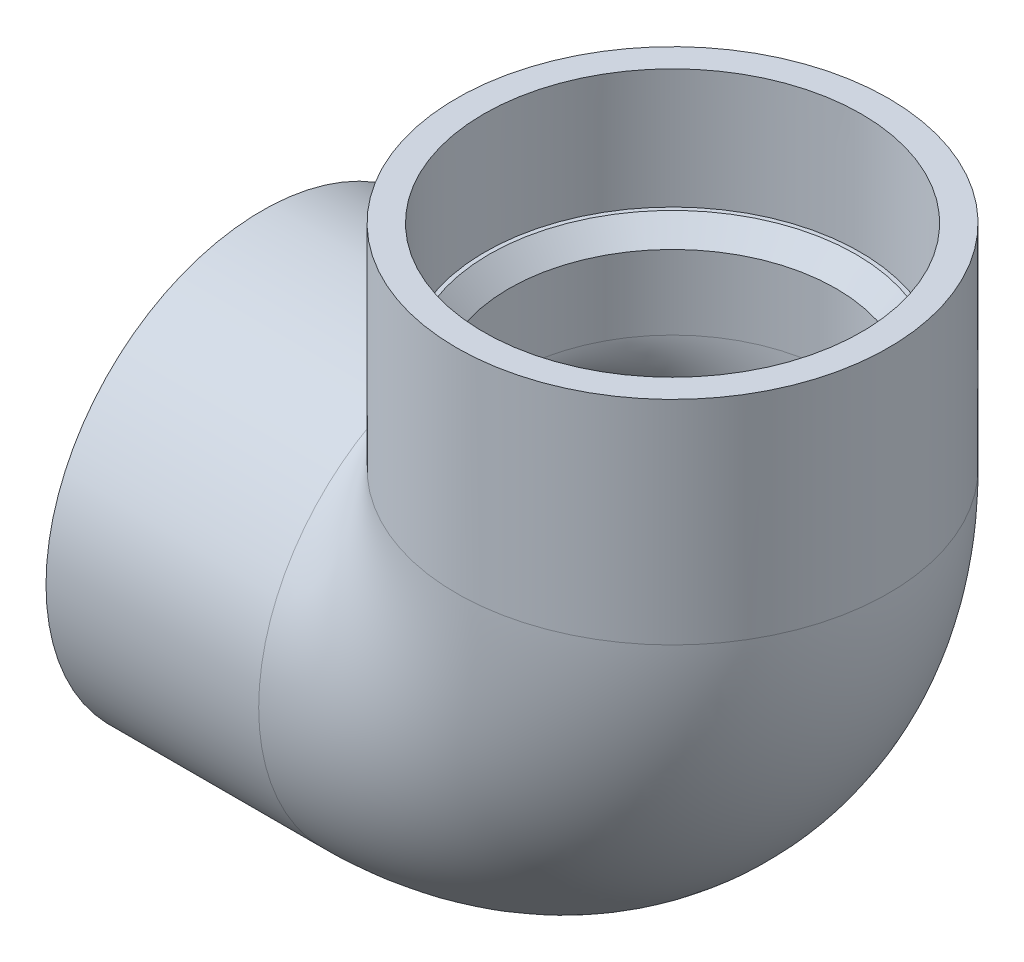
ISO-10303-21;
HEADER;
FILE_DESCRIPTION(('STEP AP214'),'2;1');
FILE_NAME('part.step','',(''),(''),'','','');
FILE_SCHEMA(('AUTOMOTIVE_DESIGN { 1 0 10303 214 1 1 1 1 }'));
ENDSEC;
DATA;
#1=APPLICATION_CONTEXT('core data for automotive mechanical design processes');
#2=APPLICATION_PROTOCOL_DEFINITION('international standard','automotive_design',2000,#1);
#3=PRODUCT_CONTEXT('',#1,'mechanical');
#4=PRODUCT('Part','Part','',(#3));
#5=PRODUCT_RELATED_PRODUCT_CATEGORY('part','',(#4));
#6=PRODUCT_DEFINITION_FORMATION('','',#4);
#7=PRODUCT_DEFINITION_CONTEXT('part definition',#1,'design');
#8=PRODUCT_DEFINITION('design','',#6,#7);
#9=PRODUCT_DEFINITION_SHAPE('','',#8);
#10=(LENGTH_UNIT() NAMED_UNIT(*) SI_UNIT(.MILLI.,.METRE.));
#11=(NAMED_UNIT(*) PLANE_ANGLE_UNIT() SI_UNIT($,.RADIAN.));
#12=(NAMED_UNIT(*) SI_UNIT($,.STERADIAN.) SOLID_ANGLE_UNIT());
#13=UNCERTAINTY_MEASURE_WITH_UNIT(LENGTH_MEASURE(1.E-05),#10,'distance_accuracy_value','');
#14=(GEOMETRIC_REPRESENTATION_CONTEXT(3) GLOBAL_UNCERTAINTY_ASSIGNED_CONTEXT((#13)) GLOBAL_UNIT_ASSIGNED_CONTEXT((#10,
#11,#12)) REPRESENTATION_CONTEXT('',''));
#15=CARTESIAN_POINT('',(0.,0.,0.));
#16=DIRECTION('',(0.,0.,1.));
#17=DIRECTION('',(1.,0.,0.));
#18=AXIS2_PLACEMENT_3D('',#15,#16,#17);
#19=CARTESIAN_POINT('',(-65.88125,-34.671,0.));
#20=DIRECTION('',(-1.,0.,0.));
#21=DIRECTION('',(0.,0.,1.));
#22=AXIS2_PLACEMENT_3D('',#19,#20,#21);
#23=PLANE('',#22);
#24=CARTESIAN_POINT('',(-65.88125,0.,0.));
#25=DIRECTION('',(-1.,0.,0.));
#26=DIRECTION('',(0.,0.,1.));
#27=AXIS2_PLACEMENT_3D('',#24,#25,#26);
#28=CIRCLE('',#27,34.671);
#29=CARTESIAN_POINT('',(-65.88125,0.,34.671));
#30=VERTEX_POINT('',#29);
#31=EDGE_CURVE('E58',#30,#30,#28,.T.);
#32=ORIENTED_EDGE('',*,*,#31,.T.);
#33=EDGE_LOOP('',(#32));
#34=FACE_BOUND('',#33,.T.);
#35=CARTESIAN_POINT('',(-65.88125,0.,0.));
#36=DIRECTION('',(-1.,0.,0.));
#37=DIRECTION('',(0.,0.,1.));
#38=AXIS2_PLACEMENT_3D('',#35,#36,#37);
#39=CIRCLE('',#38,30.3149);
#40=CARTESIAN_POINT('',(-65.88125,0.,30.3149));
#41=VERTEX_POINT('',#40);
#42=EDGE_CURVE('E72',#41,#41,#39,.T.);
#43=ORIENTED_EDGE('',*,*,#42,.F.);
#44=EDGE_LOOP('',(#43));
#45=FACE_BOUND('',#44,.T.);
#46=ADVANCED_FACE('F36',(#34,#45),#23,.T.);
#47=CARTESIAN_POINT('',(-31.75,0.,0.));
#48=DIRECTION('',(-1.,0.,0.));
#49=DIRECTION('',(0.,0.,1.));
#50=AXIS2_PLACEMENT_3D('',#47,#48,#49);
#51=CONICAL_SURFACE('',#50,30.0863,0.00669757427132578);
#52=ORIENTED_EDGE('',*,*,#42,.T.);
#53=EDGE_LOOP('',(#52));
#54=FACE_BOUND('',#53,.T.);
#55=CARTESIAN_POINT('',(-31.75,0.,0.));
#56=DIRECTION('',(-1.,0.,0.));
#57=DIRECTION('',(0.,0.,1.));
#58=AXIS2_PLACEMENT_3D('',#55,#56,#57);
#59=CIRCLE('',#58,30.0863);
#60=CARTESIAN_POINT('',(-31.75,0.,30.0863));
#61=VERTEX_POINT('',#60);
#62=EDGE_CURVE('E69',#61,#61,#59,.T.);
#63=ORIENTED_EDGE('',*,*,#62,.F.);
#64=EDGE_LOOP('',(#63));
#65=FACE_BOUND('',#64,.T.);
#66=ADVANCED_FACE('F104',(#54,#65),#51,.F.);
#67=CARTESIAN_POINT('',(-65.88125,0.,0.));
#68=DIRECTION('',(-1.,0.,0.));
#69=DIRECTION('',(0.,0.,1.));
#70=AXIS2_PLACEMENT_3D('',#67,#68,#69);
#71=CYLINDRICAL_SURFACE('',#70,34.671);
#72=CARTESIAN_POINT('',(0.,0.,0.));
#73=DIRECTION('',(-0.707106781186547,-0.707106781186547,0.));
#74=DIRECTION('',(-0.707106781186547,0.707106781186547,0.));
#75=AXIS2_PLACEMENT_3D('',#72,#73,#74);
#76=ELLIPSE('',#75,49.0321984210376,34.671);
#77=CARTESIAN_POINT('',(-31.75,31.75,-13.928953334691));
#78=VERTEX_POINT('',#77);
#79=CARTESIAN_POINT('',(-31.75,31.75,13.928953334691));
#80=VERTEX_POINT('',#79);
#81=EDGE_CURVE('E57',#78,#80,#76,.F.);
#82=ORIENTED_EDGE('',*,*,#81,.F.);
#83=CARTESIAN_POINT('',(-31.75,0.,0.));
#84=DIRECTION('',(-1.,0.,0.));
#85=DIRECTION('',(0.,0.,1.));
#86=AXIS2_PLACEMENT_3D('',#83,#84,#85);
#87=CIRCLE('',#86,34.671);
#88=EDGE_CURVE('E64',#78,#80,#87,.T.);
#89=ORIENTED_EDGE('',*,*,#88,.T.);
#90=EDGE_LOOP('',(#82,#89));
#91=FACE_BOUND('',#90,.T.);
#92=ORIENTED_EDGE('',*,*,#31,.F.);
#93=EDGE_LOOP('',(#92));
#94=FACE_BOUND('',#93,.T.);
#95=ADVANCED_FACE('F62',(#91,#94),#71,.T.);
#96=CARTESIAN_POINT('',(-31.75,31.75,0.));
#97=DIRECTION('',(0.,0.,-1.));
#98=DIRECTION('',(-1.,0.,0.));
#99=AXIS2_PLACEMENT_3D('',#96,#97,#98);
#100=TOROIDAL_SURFACE('',#99,31.75,26.2509);
#101=CARTESIAN_POINT('',(0.,31.75,0.));
#102=DIRECTION('',(0.,1.,0.));
#103=DIRECTION('',(0.,0.,-1.));
#104=AXIS2_PLACEMENT_3D('',#101,#102,#103);
#105=CIRCLE('',#104,26.2509);
#106=CARTESIAN_POINT('',(26.2509,31.75,0.));
#107=VERTEX_POINT('',#106);
#108=EDGE_CURVE('E59',#107,#107,#105,.T.);
#109=CARTESIAN_POINT('',(-31.75,0.,0.));
#110=DIRECTION('',(1.,0.,0.));
#111=DIRECTION('',(0.,0.,-1.));
#112=AXIS2_PLACEMENT_3D('',#109,#110,#111);
#113=CIRCLE('',#112,26.2509);
#114=CARTESIAN_POINT('',(-31.75,-26.2509,0.));
#115=VERTEX_POINT('',#114);
#116=EDGE_CURVE('E65',#115,#115,#113,.T.);
#117=CARTESIAN_POINT('',(-31.75,31.75,0.));
#118=DIRECTION('',(0.,0.,-1.));
#119=DIRECTION('',(-1.,0.,0.));
#120=AXIS2_PLACEMENT_3D('',#117,#118,#119);
#121=CIRCLE('',#120,58.0009);
#122=EDGE_CURVE('',#107,#115,#121,.T.);
#123=ORIENTED_EDGE('',*,*,#108,.T.);
#124=ORIENTED_EDGE('',*,*,#116,.F.);
#125=ORIENTED_EDGE('',*,*,#122,.T.);
#126=ORIENTED_EDGE('',*,*,#122,.F.);
#127=EDGE_LOOP('',(#123,#125,#124,#126));
#128=FACE_BOUND('',#127,.T.);
#129=ADVANCED_FACE('F116',(#128),#100,.F.);
#130=CARTESIAN_POINT('',(-63.5,31.75,0.));
#131=DIRECTION('',(0.,-1.,0.));
#132=DIRECTION('',(-1.,0.,0.));
#133=AXIS2_PLACEMENT_3D('',#130,#131,#132);
#134=CIRCLE('',#133,34.671);
#135=TRIMMED_CURVE('',#134,(PARAMETER_VALUE(-2.72816941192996)),
(PARAMETER_VALUE(2.72816941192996)),.T.,.PARAMETER.);
#136=CARTESIAN_POINT('',(-31.75,31.75,0.));
#137=DIRECTION('',(0.,0.,-1.));
#138=AXIS1_PLACEMENT('',#136,#137);
#139=SURFACE_OF_REVOLUTION('',#135,#138);
#140=CARTESIAN_POINT('',(0.,31.75,0.));
#141=DIRECTION('',(0.,1.,0.));
#142=DIRECTION('',(0.,0.,-1.));
#143=AXIS2_PLACEMENT_3D('',#140,#141,#142);
#144=CIRCLE('',#143,34.671);
#145=EDGE_CURVE('E51',#80,#78,#144,.T.);
#146=ORIENTED_EDGE('',*,*,#145,.F.);
#147=ORIENTED_EDGE('',*,*,#88,.F.);
#148=EDGE_LOOP('',(#146,#147));
#149=FACE_BOUND('',#148,.T.);
#150=ADVANCED_FACE('F68',(#149),#139,.T.);
#151=CARTESIAN_POINT('',(34.671,65.88125,0.));
#152=DIRECTION('',(0.,1.,0.));
#153=DIRECTION('',(0.,0.,1.));
#154=AXIS2_PLACEMENT_3D('',#151,#152,#153);
#155=PLANE('',#154);
#156=CARTESIAN_POINT('',(0.,65.88125,0.));
#157=DIRECTION('',(0.,-1.,0.));
#158=DIRECTION('',(0.,0.,-1.));
#159=AXIS2_PLACEMENT_3D('',#156,#157,#158);
#160=CIRCLE('',#159,30.3149);
#161=CARTESIAN_POINT('',(0.,65.88125,-30.3149));
#162=VERTEX_POINT('',#161);
#163=EDGE_CURVE('E167',#162,#162,#160,.T.);
#164=ORIENTED_EDGE('',*,*,#163,.T.);
#165=EDGE_LOOP('',(#164));
#166=FACE_BOUND('',#165,.T.);
#167=CARTESIAN_POINT('',(0.,65.88125,0.));
#168=DIRECTION('',(0.,-1.,0.));
#169=DIRECTION('',(0.,0.,-1.));
#170=AXIS2_PLACEMENT_3D('',#167,#168,#169);
#171=CIRCLE('',#170,34.671);
#172=CARTESIAN_POINT('',(0.,65.88125,-34.671));
#173=VERTEX_POINT('',#172);
#174=EDGE_CURVE('E66',#173,#173,#171,.T.);
#175=ORIENTED_EDGE('',*,*,#174,.F.);
#176=EDGE_LOOP('',(#175));
#177=FACE_BOUND('',#176,.T.);
#178=ADVANCED_FACE('F119',(#166,#177),#155,.T.);
#179=CARTESIAN_POINT('',(0.,0.,0.));
#180=DIRECTION('',(0.,-1.,0.));
#181=DIRECTION('',(0.,0.,-1.));
#182=AXIS2_PLACEMENT_3D('',#179,#180,#181);
#183=CYLINDRICAL_SURFACE('',#182,34.671);
#184=ORIENTED_EDGE('',*,*,#174,.T.);
#185=EDGE_LOOP('',(#184));
#186=FACE_BOUND('',#185,.T.);
#187=ORIENTED_EDGE('',*,*,#145,.T.);
#188=ORIENTED_EDGE('',*,*,#81,.T.);
#189=EDGE_LOOP('',(#187,#188));
#190=FACE_BOUND('',#189,.T.);
#191=ADVANCED_FACE('F56',(#186,#190),#183,.T.);
#192=CARTESIAN_POINT('',(0.,65.88125,0.));
#193=DIRECTION('',(0.,1.,0.));
#194=DIRECTION('',(0.,0.,1.));
#195=AXIS2_PLACEMENT_3D('',#192,#193,#194);
#196=CONICAL_SURFACE('',#195,30.3149,0.00669757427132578);
#197=CARTESIAN_POINT('',(0.,31.75,0.));
#198=DIRECTION('',(0.,1.,0.));
#199=DIRECTION('',(-1.,0.,0.));
#200=AXIS2_PLACEMENT_3D('',#197,#198,#199);
#201=CIRCLE('',#200,30.0863);
#202=CARTESIAN_POINT('',(-30.0863,31.75,0.));
#203=VERTEX_POINT('',#202);
#204=EDGE_CURVE('E162',#203,#203,#201,.T.);
#205=ORIENTED_EDGE('',*,*,#204,.F.);
#206=EDGE_LOOP('',(#205));
#207=FACE_BOUND('',#206,.T.);
#208=ORIENTED_EDGE('',*,*,#163,.F.);
#209=EDGE_LOOP('',(#208));
#210=FACE_BOUND('',#209,.T.);
#211=ADVANCED_FACE('F128',(#207,#210),#196,.F.);
#212=CARTESIAN_POINT('',(-150.978157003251,0.,0.));
#213=DIRECTION('',(1.,0.,0.));
#214=DIRECTION('',(0.,0.,-1.));
#215=AXIS2_PLACEMENT_3D('',#212,#213,#214);
#216=CYLINDRICAL_SURFACE('',#215,30.0863);
#217=ORIENTED_EDGE('',*,*,#62,.T.);
#218=EDGE_LOOP('',(#217));
#219=FACE_BOUND('',#218,.T.);
#220=CARTESIAN_POINT('',(-46.83125,0.,0.));
#221=DIRECTION('',(-1.,0.,0.));
#222=DIRECTION('',(0.,0.,1.));
#223=AXIS2_PLACEMENT_3D('',#220,#221,#222);
#224=CIRCLE('',#223,30.0863);
#225=CARTESIAN_POINT('',(-46.83125,0.,30.0863));
#226=VERTEX_POINT('',#225);
#227=EDGE_CURVE('E161',#226,#226,#224,.T.);
#228=ORIENTED_EDGE('',*,*,#227,.F.);
#229=EDGE_LOOP('',(#228));
#230=FACE_BOUND('',#229,.T.);
#231=ADVANCED_FACE('F132',(#219,#230),#216,.T.);
#232=CARTESIAN_POINT('',(-150.978157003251,0.,0.));
#233=DIRECTION('',(1.,0.,0.));
#234=DIRECTION('',(0.,0.,-1.));
#235=AXIS2_PLACEMENT_3D('',#232,#233,#234);
#236=CYLINDRICAL_SURFACE('',#235,26.2509);
#237=CARTESIAN_POINT('',(-43.65625,0.,0.));
#238=DIRECTION('',(-1.,0.,0.));
#239=DIRECTION('',(0.,0.,1.));
#240=AXIS2_PLACEMENT_3D('',#237,#238,#239);
#241=CIRCLE('',#240,26.2509);
#242=CARTESIAN_POINT('',(-43.65625,0.,26.2509));
#243=VERTEX_POINT('',#242);
#244=EDGE_CURVE('E81',#243,#243,#241,.T.);
#245=ORIENTED_EDGE('',*,*,#244,.T.);
#246=EDGE_LOOP('',(#245));
#247=FACE_BOUND('',#246,.T.);
#248=ORIENTED_EDGE('',*,*,#116,.T.);
#249=EDGE_LOOP('',(#248));
#250=FACE_BOUND('',#249,.T.);
#251=ADVANCED_FACE('F136',(#247,#250),#236,.F.);
#252=CARTESIAN_POINT('',(-46.83125,-34.671,0.));
#253=DIRECTION('',(-1.,0.,0.));
#254=DIRECTION('',(0.,0.,1.));
#255=AXIS2_PLACEMENT_3D('',#252,#253,#254);
#256=PLANE('',#255);
#257=CARTESIAN_POINT('',(-46.83125,0.,0.));
#258=DIRECTION('',(-1.,0.,0.));
#259=DIRECTION('',(0.,0.,1.));
#260=AXIS2_PLACEMENT_3D('',#257,#258,#259);
#261=CIRCLE('',#260,29.4259);
#262=CARTESIAN_POINT('',(-46.83125,0.,29.4259));
#263=VERTEX_POINT('',#262);
#264=EDGE_CURVE('E85',#263,#263,#261,.F.);
#265=ORIENTED_EDGE('',*,*,#264,.T.);
#266=EDGE_LOOP('',(#265));
#267=FACE_BOUND('',#266,.T.);
#268=ORIENTED_EDGE('',*,*,#227,.T.);
#269=EDGE_LOOP('',(#268));
#270=FACE_BOUND('',#269,.T.);
#271=ADVANCED_FACE('F140',(#267,#270),#256,.T.);
#272=CARTESIAN_POINT('',(0.,150.978157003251,0.));
#273=DIRECTION('',(0.,-1.,0.));
#274=DIRECTION('',(1.,0.,0.));
#275=AXIS2_PLACEMENT_3D('',#272,#273,#274);
#276=CYLINDRICAL_SURFACE('',#275,30.0863);
#277=ORIENTED_EDGE('',*,*,#204,.T.);
#278=EDGE_LOOP('',(#277));
#279=FACE_BOUND('',#278,.T.);
#280=CARTESIAN_POINT('',(0.,46.83125,0.));
#281=DIRECTION('',(0.,1.,0.));
#282=DIRECTION('',(0.,0.,1.));
#283=AXIS2_PLACEMENT_3D('',#280,#281,#282);
#284=CIRCLE('',#283,30.0863);
#285=CARTESIAN_POINT('',(0.,46.83125,30.0863));
#286=VERTEX_POINT('',#285);
#287=EDGE_CURVE('E158',#286,#286,#284,.T.);
#288=ORIENTED_EDGE('',*,*,#287,.F.);
#289=EDGE_LOOP('',(#288));
#290=FACE_BOUND('',#289,.T.);
#291=ADVANCED_FACE('F144',(#279,#290),#276,.T.);
#292=CARTESIAN_POINT('',(0.,150.978157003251,0.));
#293=DIRECTION('',(0.,-1.,0.));
#294=DIRECTION('',(1.,0.,0.));
#295=AXIS2_PLACEMENT_3D('',#292,#293,#294);
#296=CYLINDRICAL_SURFACE('',#295,26.2509);
#297=CARTESIAN_POINT('',(0.,43.65625,0.));
#298=DIRECTION('',(0.,1.,0.));
#299=DIRECTION('',(-1.,0.,0.));
#300=AXIS2_PLACEMENT_3D('',#297,#298,#299);
#301=CIRCLE('',#300,26.2509);
#302=CARTESIAN_POINT('',(-26.2509,43.65625,0.));
#303=VERTEX_POINT('',#302);
#304=EDGE_CURVE('E45',#303,#303,#301,.T.);
#305=ORIENTED_EDGE('',*,*,#304,.T.);
#306=EDGE_LOOP('',(#305));
#307=FACE_BOUND('',#306,.T.);
#308=ORIENTED_EDGE('',*,*,#108,.F.);
#309=EDGE_LOOP('',(#308));
#310=FACE_BOUND('',#309,.T.);
#311=ADVANCED_FACE('F91',(#307,#310),#296,.F.);
#312=CARTESIAN_POINT('',(34.671,46.83125,0.));
#313=DIRECTION('',(0.,1.,0.));
#314=DIRECTION('',(0.,0.,1.));
#315=AXIS2_PLACEMENT_3D('',#312,#313,#314);
#316=PLANE('',#315);
#317=CARTESIAN_POINT('',(0.,46.83125,0.));
#318=DIRECTION('',(0.,1.,0.));
#319=DIRECTION('',(0.,0.,1.));
#320=AXIS2_PLACEMENT_3D('',#317,#318,#319);
#321=CIRCLE('',#320,29.4259);
#322=CARTESIAN_POINT('',(0.,46.83125,29.4259));
#323=VERTEX_POINT('',#322);
#324=EDGE_CURVE('E12',#323,#323,#321,.F.);
#325=ORIENTED_EDGE('',*,*,#324,.T.);
#326=EDGE_LOOP('',(#325));
#327=FACE_BOUND('',#326,.T.);
#328=ORIENTED_EDGE('',*,*,#287,.T.);
#329=EDGE_LOOP('',(#328));
#330=FACE_BOUND('',#329,.T.);
#331=ADVANCED_FACE('F100',(#327,#330),#316,.T.);
#332=CARTESIAN_POINT('',(-43.65625,0.,0.));
#333=DIRECTION('',(-1.,0.,0.));
#334=DIRECTION('',(0.,0.,1.));
#335=AXIS2_PLACEMENT_3D('',#332,#333,#334);
#336=CONICAL_SURFACE('',#335,26.2509,0.78539816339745);
#337=CARTESIAN_POINT('',(-46.83125,0.,29.4259));
#338=CARTESIAN_POINT('',(-46.7981770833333,0.,29.3928270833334));
#339=CARTESIAN_POINT('',(-46.7651041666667,0.,29.3597541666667));
#340=CARTESIAN_POINT('',(-46.6989583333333,0.,29.2936083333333));
#341=CARTESIAN_POINT('',(-46.6658854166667,0.,29.2605354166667));
#342=CARTESIAN_POINT('',(-46.5997395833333,0.,29.1943895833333));
#343=CARTESIAN_POINT('',(-46.5666666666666,0.,29.1613166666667));
#344=CARTESIAN_POINT('',(-46.5005208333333,0.,29.0951708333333));
#345=CARTESIAN_POINT('',(-46.4674479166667,0.,29.0620979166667));
#346=CARTESIAN_POINT('',(-46.4013020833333,0.,28.9959520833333));
#347=CARTESIAN_POINT('',(-46.3682291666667,0.,28.9628791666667));
#348=CARTESIAN_POINT('',(-46.3020833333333,0.,28.8967333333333));
#349=CARTESIAN_POINT('',(-46.2690104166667,0.,28.8636604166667));
#350=CARTESIAN_POINT('',(-46.2028645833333,0.,28.7975145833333));
#351=CARTESIAN_POINT('',(-46.1697916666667,0.,28.7644416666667));
#352=CARTESIAN_POINT('',(-46.1036458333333,0.,28.6982958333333));
#353=CARTESIAN_POINT('',(-46.0705729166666,0.,28.6652229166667));
#354=CARTESIAN_POINT('',(-46.0044270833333,0.,28.5990770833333));
#355=CARTESIAN_POINT('',(-45.9713541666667,0.,28.5660041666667));
#356=CARTESIAN_POINT('',(-45.9052083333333,0.,28.4998583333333));
#357=CARTESIAN_POINT('',(-45.8721354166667,0.,28.4667854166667));
#358=CARTESIAN_POINT('',(-45.8059895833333,0.,28.4006395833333));
#359=CARTESIAN_POINT('',(-45.7729166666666,0.,28.3675666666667));
#360=CARTESIAN_POINT('',(-45.7067708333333,0.,28.3014208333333));
#361=CARTESIAN_POINT('',(-45.6736979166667,0.,28.2683479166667));
#362=CARTESIAN_POINT('',(-45.6075520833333,0.,28.2022020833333));
#363=CARTESIAN_POINT('',(-45.5744791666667,0.,28.1691291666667));
#364=CARTESIAN_POINT('',(-45.5083333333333,0.,28.1029833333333));
#365=CARTESIAN_POINT('',(-45.4752604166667,0.,28.0699104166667));
#366=CARTESIAN_POINT('',(-45.4091145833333,0.,28.0037645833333));
#367=CARTESIAN_POINT('',(-45.3760416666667,0.,27.9706916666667));
#368=CARTESIAN_POINT('',(-45.3098958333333,0.,27.9045458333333));
#369=CARTESIAN_POINT('',(-45.2768229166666,0.,27.8714729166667));
#370=CARTESIAN_POINT('',(-45.2106770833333,0.,27.8053270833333));
#371=CARTESIAN_POINT('',(-45.1776041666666,0.,27.7722541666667));
#372=CARTESIAN_POINT('',(-45.1114583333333,0.,27.7061083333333));
#373=CARTESIAN_POINT('',(-45.0783854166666,0.,27.6730354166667));
#374=CARTESIAN_POINT('',(-45.0122395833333,0.,27.6068895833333));
#375=CARTESIAN_POINT('',(-44.9791666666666,0.,27.5738166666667));
#376=CARTESIAN_POINT('',(-44.9130208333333,0.,27.5076708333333));
#377=CARTESIAN_POINT('',(-44.8799479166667,0.,27.4745979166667));
#378=CARTESIAN_POINT('',(-44.8138020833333,0.,27.4084520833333));
#379=CARTESIAN_POINT('',(-44.7807291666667,0.,27.3753791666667));
#380=CARTESIAN_POINT('',(-44.7145833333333,0.,27.3092333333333));
#381=CARTESIAN_POINT('',(-44.6815104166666,0.,27.2761604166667));
#382=CARTESIAN_POINT('',(-44.6153645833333,0.,27.2100145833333));
#383=CARTESIAN_POINT('',(-44.5822916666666,0.,27.1769416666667));
#384=CARTESIAN_POINT('',(-44.5161458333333,0.,27.1107958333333));
#385=CARTESIAN_POINT('',(-44.4830729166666,0.,27.0777229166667));
#386=CARTESIAN_POINT('',(-44.4169270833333,0.,27.0115770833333));
#387=CARTESIAN_POINT('',(-44.3838541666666,0.,26.9785041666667));
#388=CARTESIAN_POINT('',(-44.3177083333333,0.,26.9123583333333));
#389=CARTESIAN_POINT('',(-44.2846354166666,0.,26.8792854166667));
#390=CARTESIAN_POINT('',(-44.2184895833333,0.,26.8131395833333));
#391=CARTESIAN_POINT('',(-44.1854166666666,0.,26.7800666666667));
#392=CARTESIAN_POINT('',(-44.1192708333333,0.,26.7139208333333));
#393=CARTESIAN_POINT('',(-44.0861979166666,0.,26.6808479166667));
#394=CARTESIAN_POINT('',(-44.0200520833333,0.,26.6147020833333));
#395=CARTESIAN_POINT('',(-43.9869791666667,0.,26.5816291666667));
#396=CARTESIAN_POINT('',(-43.9208333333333,0.,26.5154833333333));
#397=CARTESIAN_POINT('',(-43.8877604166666,0.,26.4824104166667));
#398=CARTESIAN_POINT('',(-43.8216145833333,0.,26.4162645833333));
#399=CARTESIAN_POINT('',(-43.7885416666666,0.,26.3831916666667));
#400=CARTESIAN_POINT('',(-43.7223958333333,0.,26.3170458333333));
#401=CARTESIAN_POINT('',(-43.6893229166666,0.,26.2839729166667));
#402=CARTESIAN_POINT('',(-43.65625,0.,26.2509));
#403=B_SPLINE_CURVE_WITH_KNOTS('',3,(#337,#338,#339,#340,#341,#342,#343,#344,#345,#346,#347,
#348,#349,#350,#351,#352,#353,#354,#355,#356,#357,#358,#359,#360,#361,#362,#363,#364,#365,#366,
#367,#368,#369,#370,#371,#372,#373,#374,#375,#376,#377,#378,#379,#380,#381,#382,#383,#384,#385,
#386,#387,#388,#389,#390,#391,#392,#393,#394,#395,#396,#397,#398,#399,#400,#401,#402),
.UNSPECIFIED.,.F.,.F.,(4,2,2,2,2,2,2,2,2,2,2,2,2,2,2,2,2,2,2,2,2,2,2,2,2,2,2,2,2,2,2,2,4),(0.,
0.140316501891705,0.28063300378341,0.420949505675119,0.561266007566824,0.701582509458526,
0.841899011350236,0.982215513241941,1.12253201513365,1.26284851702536,1.40316501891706,
1.54348152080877,1.68379802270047,1.82411452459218,1.96443102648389,2.10474752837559,
2.2450640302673,2.38538053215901,2.52569703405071,2.66601353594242,2.80633003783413,
2.94664653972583,3.08696304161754,3.22727954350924,3.36759604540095,3.50791254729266,
3.64822904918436,3.78854555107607,3.92886205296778,4.06917855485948,4.20949505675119,
4.34981155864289,4.4901280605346),.UNSPECIFIED.);
#404=EDGE_CURVE('BSEAM95',#263,#243,#403,.T.);
#405=ORIENTED_EDGE('',*,*,#264,.F.);
#406=ORIENTED_EDGE('',*,*,#244,.F.);
#407=ORIENTED_EDGE('',*,*,#404,.T.);
#408=ORIENTED_EDGE('',*,*,#404,.F.);
#409=EDGE_LOOP('',(#405,#407,#406,#408));
#410=FACE_BOUND('',#409,.T.);
#411=ADVANCED_FACE('F95',(#410),#336,.F.);
#412=CARTESIAN_POINT('',(0.,43.65625,0.));
#413=DIRECTION('',(0.,1.,0.));
#414=DIRECTION('',(-1.,0.,0.));
#415=AXIS2_PLACEMENT_3D('',#412,#413,#414);
#416=CONICAL_SURFACE('',#415,26.2509,0.785398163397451);
#417=ORIENTED_EDGE('',*,*,#324,.F.);
#418=EDGE_LOOP('',(#417));
#419=FACE_BOUND('',#418,.T.);
#420=ORIENTED_EDGE('',*,*,#304,.F.);
#421=EDGE_LOOP('',(#420));
#422=FACE_BOUND('',#421,.T.);
#423=ADVANCED_FACE('F38',(#419,#422),#416,.F.);
#424=CLOSED_SHELL('',(#46,#66,#95,#129,#150,#178,#191,#211,#231,#251,#271,#291,#311,#331,#411,#423));
#425=MANIFOLD_SOLID_BREP('B2',#424);
#426=ADVANCED_BREP_SHAPE_REPRESENTATION('',(#18,#425),#14);
#427=SHAPE_DEFINITION_REPRESENTATION(#9,#426);
ENDSEC;
END-ISO-10303-21;
